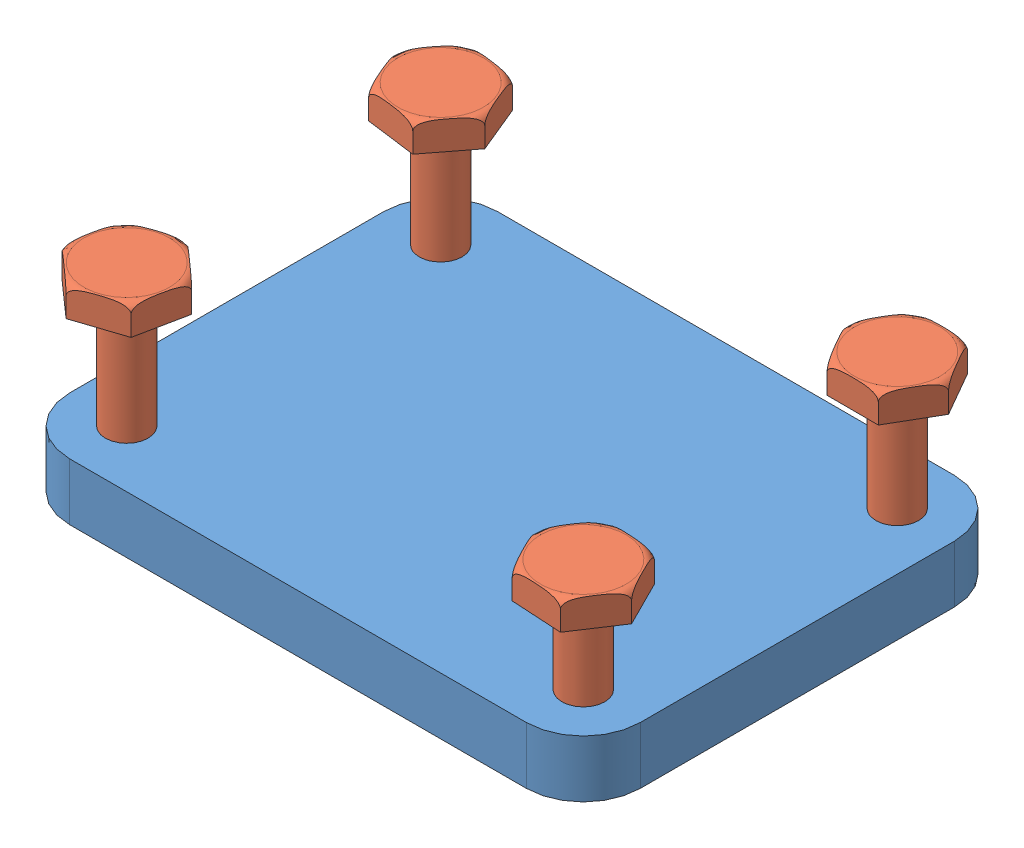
SolidWorks assembly coincident mate.SLDASM, configuration Default (file format 6000). Lengths in mm.
Overall size (206.05 71.02 157.74).
5 component instances, 2 part files, 4 mates.
Components (placement in the parent):
- base_plate-1: base_plate.SLDPRT [Default] at (-2.4395 -20.7211 8.571) size (200 20 150)
- bolt-1: bolt.SLDPRT [Default] at (-82.4395 -11.5377 -46.429) x (-0.381831 0 -0.924232) z (0.924232 0 -0.381831) size (37.56 60.93 32.74)
- bolt-2: bolt.SLDPRT [Default] at (77.5605 -13.1937 -46.429) x (0.999997 0 0.002425) z (-0.002425 0 0.999997) size (37.56 60.93 32.74)
- bolt-3: bolt.SLDPRT [Default] at (-82.4395 -11.1799 63.571) x (0.948787 0 -0.315917) z (0.315917 0 0.948787) size (37.56 60.93 32.74)
- bolt-4: bolt.SLDPRT [Default] at (77.5605 -21.2784 63.571) x (0.448221 0 0.893923) z (-0.893923 0 0.448221) size (37.56 60.93 32.74)
Mates (geometry in assembly coordinates):
- Concentric2: concentric anti-aligned: cylinder of base_plate-1 through (-82.4395 -0.7211 63.571) axis (0 1 0) radius 7.5; cylinder of bolt-3 through (-82.4395 38.8201 63.571) axis (0 -1 0) radius 7.5
- Concentric3: concentric anti-aligned: cylinder of base_plate-1 through (77.5605 -0.7211 -46.429) axis (0 1 0) radius 7.5; cylinder of bolt-2 through (77.5605 36.8063 -46.429) axis (0 -1 0) radius 7.5
- Concentric4: concentric anti-aligned: cylinder of base_plate-1 through (77.5605 -0.7211 63.571) axis (0 1 0) radius 7.5; cylinder of bolt-4 through (77.5605 28.7216 63.571) axis (0 -1 0) radius 7.5
- Concentric5: concentric aligned: cylinder of base_plate-1 through (-82.4395 -0.7211 -46.429) axis (0 1 0) radius 7.5; cylinder of bolt-1 through (-82.4395 -0.7211 -46.429) axis (0 1 0) radius 7.5
